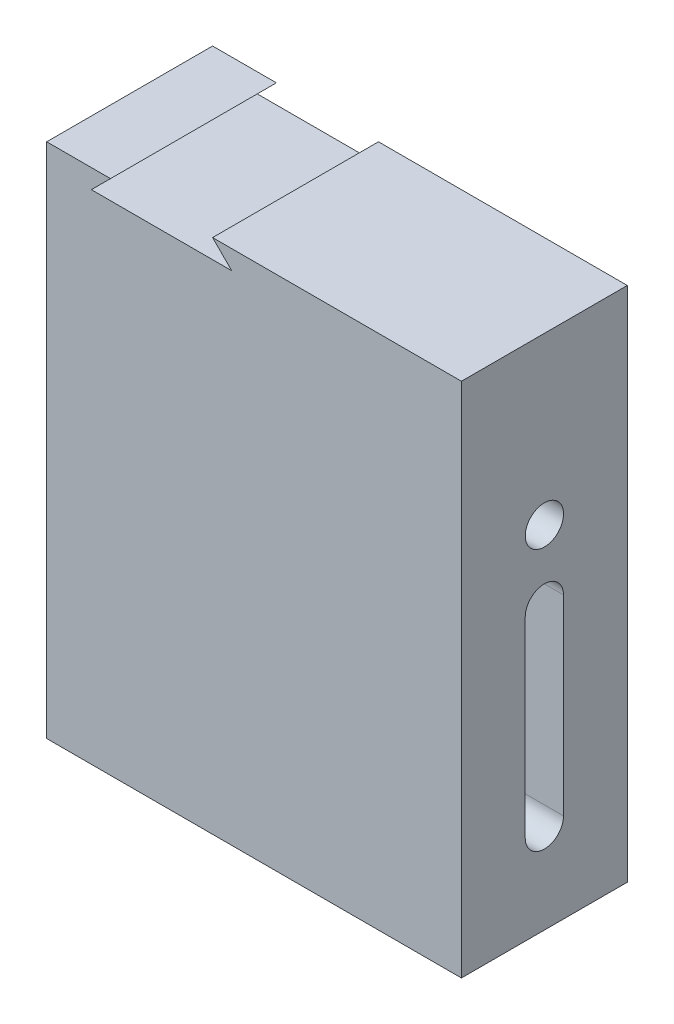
from build123d import *

# Parameters (mm, degrees)
ESQUISSE1_W             = 65
ESQUISSE1_H             = 81
BASE_EXTRUSION_DEPTH    = 26
ESQUISSE2_R             = 3
ENL_V_MAT_EXTRU_1_DEPTH = 15
ENL_V_MAT_EXTRU_2_DEPTH = 14
ENL_V_MAT_EXTRU_3_DEPTH = 108.060730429


with BuildPart() as part:
    # Esquisse1 → Base-Extrusion (new body)
    with BuildSketch(Plane.XY):
        with Locations((32.5, 40.5)):
            Rectangle(ESQUISSE1_W, ESQUISSE1_H)
    extrude(amount=BASE_EXTRUSION_DEPTH)

    # Esquisse2 → Enl_v. mat.-Extru.1 (cut)
    with BuildSketch(Plane(origin=(65, 0, 0), x_dir=(0, 0, -1), z_dir=(1, 0, 0))):
        with Locations((-13, 55)):
            Circle(ESQUISSE2_R)
    extrude(amount=-ENL_V_MAT_EXTRU_1_DEPTH, mode=Mode.SUBTRACT)

    # Esquisse3 → Enl_v. mat.-Extru.2 (cut)
    with BuildSketch(Plane(origin=(65, 0, 0), x_dir=(0, 0, -1), z_dir=(1, 0, 0))):
        with BuildLine():
            Line((-16, 44), (-16, 14))
            ThreePointArc((-16, 14), (-13, 11), (-10, 14))
            Line((-10, 14), (-10, 44))
            ThreePointArc((-10, 44), (-13, 47), (-16, 44))
        make_face()
    extrude(amount=-ENL_V_MAT_EXTRU_2_DEPTH, mode=Mode.SUBTRACT)

    # Esquisse4 → Enl_v. mat.-Extru.3 (cut, through all)
    with BuildSketch(Plane.XY.offset(26)):
        Polygon((10, 81), (26, 81), (29, 78), (7, 78), align=None)
    extrude(amount=-ENL_V_MAT_EXTRU_3_DEPTH, mode=Mode.SUBTRACT)


solid = part.part
